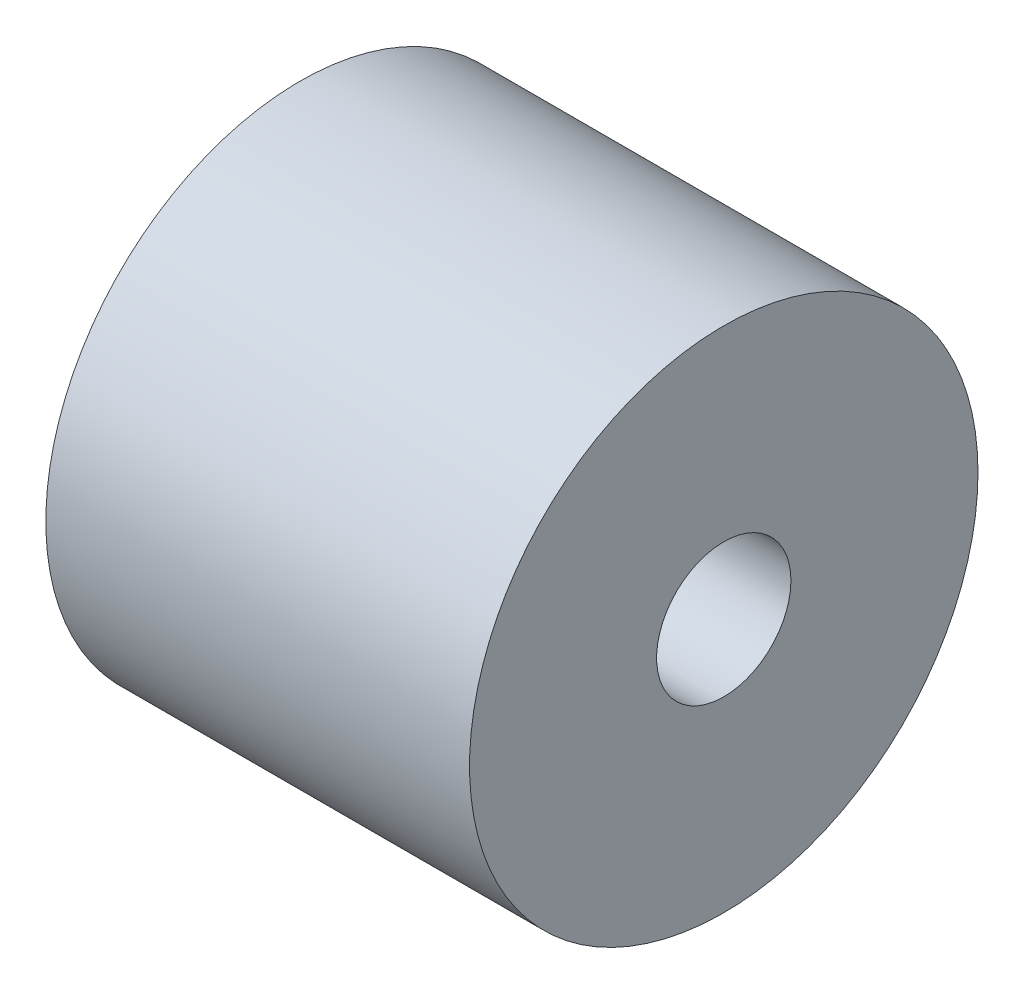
from build123d import *

# Parameters (mm, degrees)
ESQUISSE1_R        = 6
ESQUISSE1_R_2      = 1.585
BOSS_EXTRU_1_DEPTH = 5


with BuildPart() as part:
    # Esquisse1 → Boss.-Extru.1 (new, symmetric)
    with BuildSketch(Plane(origin=(0, 0, 0), x_dir=(0, 0, -1), z_dir=(1, 0, 0))):
        Circle(ESQUISSE1_R)
        Circle(ESQUISSE1_R_2, mode=Mode.SUBTRACT)
    extrude(amount=BOSS_EXTRU_1_DEPTH, both=True)


solid = part.part
